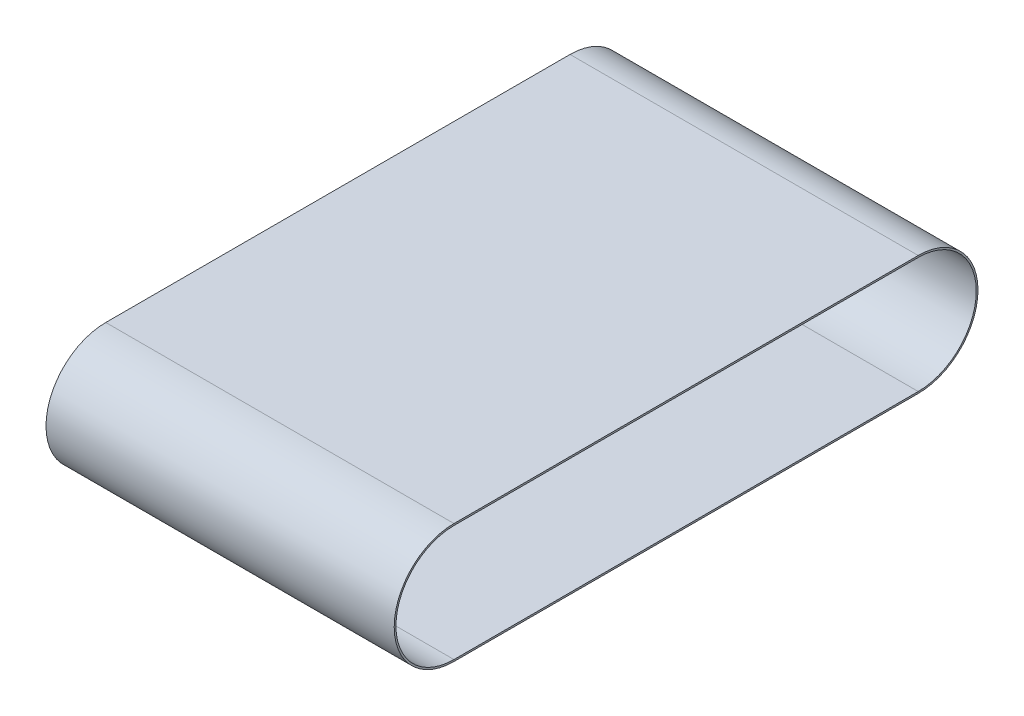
from build123d import *

# Parameters (mm, degrees)
BOSS_EXTRUDE1_DEPTH = 300


with BuildPart() as part:
    # Sketch1 → Boss-Extrude1 (new, symmetric)
    with BuildSketch(Plane(origin=(0, 0, 0), x_dir=(0, 0, -1), z_dir=(1, 0, 0))):
        with BuildLine():
            Line((0, 103), (800, 103))
            ThreePointArc((800, 103), (903, 0), (800, -103))
            Line((800, -103), (0, -103))
            ThreePointArc((0, -103), (-103, 0), (0, 103))
        make_face()
        with BuildLine():
            Line((0, 100), (800, 100))
            ThreePointArc((800, 100), (900, 0), (800, -100))
            Line((800, -100), (0, -100))
            ThreePointArc((0, -100), (-100, 0), (0, 100))
        make_face(mode=Mode.SUBTRACT)
    extrude(amount=BOSS_EXTRUDE1_DEPTH, both=True)


solid = part.part
